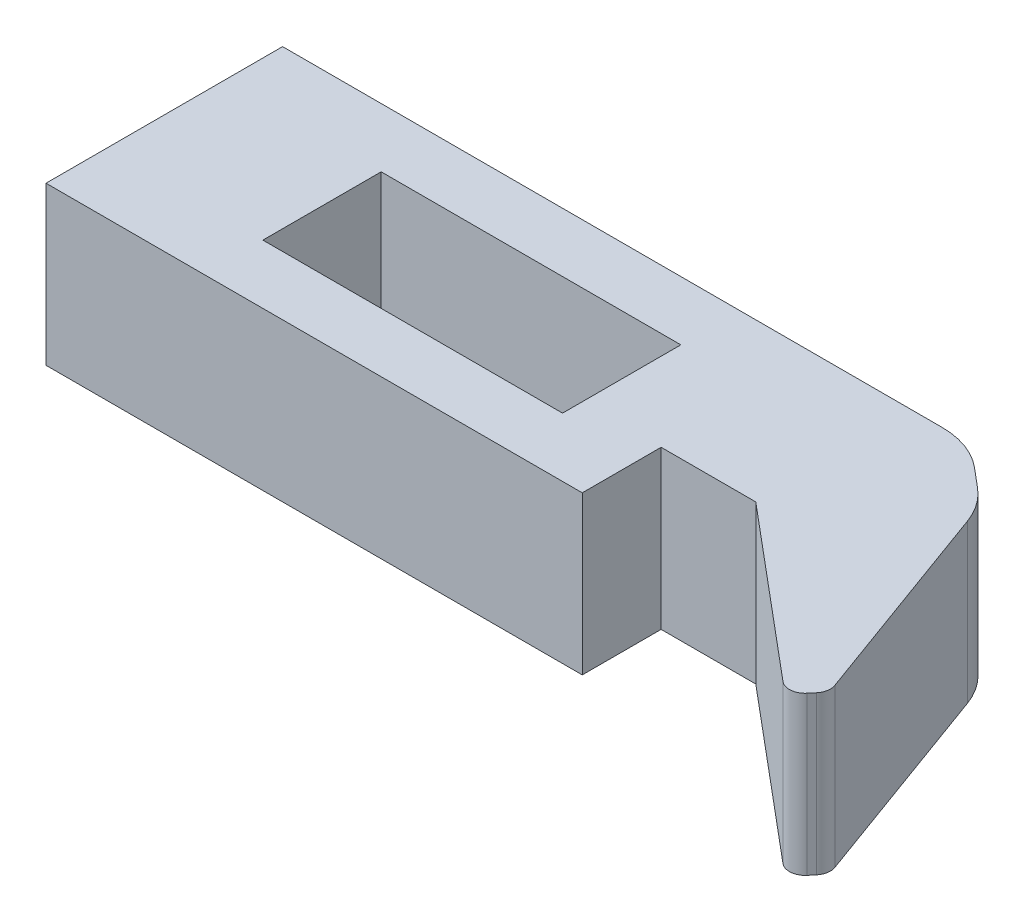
ISO-10303-21;
HEADER;
FILE_DESCRIPTION(('STEP AP214'),'2;1');
FILE_NAME('part.step','',(''),(''),'','','');
FILE_SCHEMA(('AUTOMOTIVE_DESIGN { 1 0 10303 214 1 1 1 1 }'));
ENDSEC;
DATA;
#1=APPLICATION_CONTEXT('core data for automotive mechanical design processes');
#2=APPLICATION_PROTOCOL_DEFINITION('international standard','automotive_design',2000,#1);
#3=PRODUCT_CONTEXT('',#1,'mechanical');
#4=PRODUCT('Part','Part','',(#3));
#5=PRODUCT_RELATED_PRODUCT_CATEGORY('part','',(#4));
#6=PRODUCT_DEFINITION_FORMATION('','',#4);
#7=PRODUCT_DEFINITION_CONTEXT('part definition',#1,'design');
#8=PRODUCT_DEFINITION('design','',#6,#7);
#9=PRODUCT_DEFINITION_SHAPE('','',#8);
#10=(LENGTH_UNIT() NAMED_UNIT(*) SI_UNIT(.MILLI.,.METRE.));
#11=(NAMED_UNIT(*) PLANE_ANGLE_UNIT() SI_UNIT($,.RADIAN.));
#12=(NAMED_UNIT(*) SI_UNIT($,.STERADIAN.) SOLID_ANGLE_UNIT());
#13=UNCERTAINTY_MEASURE_WITH_UNIT(LENGTH_MEASURE(1.E-05),#10,'distance_accuracy_value','');
#14=(GEOMETRIC_REPRESENTATION_CONTEXT(3) GLOBAL_UNCERTAINTY_ASSIGNED_CONTEXT((#13)) GLOBAL_UNIT_ASSIGNED_CONTEXT((#10,
#11,#12)) REPRESENTATION_CONTEXT('',''));
#15=CARTESIAN_POINT('',(0.,0.,0.));
#16=DIRECTION('',(0.,0.,1.));
#17=DIRECTION('',(1.,0.,0.));
#18=AXIS2_PLACEMENT_3D('',#15,#16,#17);
#19=CARTESIAN_POINT('',(0.,2.,0.));
#20=DIRECTION('',(0.,-1.,0.));
#21=DIRECTION('',(0.,0.,-1.));
#22=AXIS2_PLACEMENT_3D('',#19,#20,#21);
#23=PLANE('',#22);
#24=DIRECTION('',(0.642787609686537,0.,-0.76604444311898));
#25=VECTOR('',#24,1.);
#26=CARTESIAN_POINT('',(7.68370854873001,2.,0.896273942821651));
#27=LINE('',#26,#25);
#28=CARTESIAN_POINT('',(6.52669085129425,2.,2.27515394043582));
#29=VERTEX_POINT('',#28);
#30=CARTESIAN_POINT('',(6.5810256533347,2.,2.21040024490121));
#31=VERTEX_POINT('',#30);
#32=EDGE_CURVE('E232',#29,#31,#27,.T.);
#33=ORIENTED_EDGE('',*,*,#32,.T.);
#34=CARTESIAN_POINT('',(6.4278167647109,2.,2.0818427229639));
#35=DIRECTION('',(0.,-1.,0.));
#36=DIRECTION('',(0.,0.,-1.));
#37=AXIS2_PLACEMENT_3D('',#34,#35,#36);
#38=CIRCLE('',#37,0.2);
#39=CARTESIAN_POINT('',(6.61575528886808,2.,2.01343869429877));
#40=VERTEX_POINT('',#39);
#41=EDGE_CURVE('E282',#31,#40,#38,.F.);
#42=ORIENTED_EDGE('',*,*,#41,.T.);
#43=DIRECTION('',(0.342020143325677,0.,0.939692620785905));
#44=VECTOR('',#43,1.);
#45=CARTESIAN_POINT('',(6.65524837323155,2.,2.12194505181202));
#46=LINE('',#45,#44);
#47=CARTESIAN_POINT('',(5.65242793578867,2.,-0.633281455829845));
#48=VERTEX_POINT('',#47);
#49=EDGE_CURVE('E184',#48,#40,#46,.T.);
#50=ORIENTED_EDGE('',*,*,#49,.F.);
#51=CARTESIAN_POINT('',(4.71273531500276,2.,-0.291261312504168));
#52=DIRECTION('',(0.,-1.,0.));
#53=DIRECTION('',(0.,0.,-1.));
#54=AXIS2_PLACEMENT_3D('',#51,#52,#53);
#55=CIRCLE('',#54,1.);
#56=CARTESIAN_POINT('',(5.3555229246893,2.,-1.05730575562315));
#57=VERTEX_POINT('',#56);
#58=EDGE_CURVE('E267',#48,#57,#55,.F.);
#59=ORIENTED_EDGE('',*,*,#58,.T.);
#60=DIRECTION('',(-0.76604444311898,0.,-0.642787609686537));
#61=VECTOR('',#60,1.);
#62=CARTESIAN_POINT('',(4.8279404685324,2.,-1.5));
#63=LINE('',#62,#61);
#64=CARTESIAN_POINT('',(5.10675784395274,2.,-1.26604444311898));
#65=VERTEX_POINT('',#64);
#66=EDGE_CURVE('E235',#57,#65,#63,.T.);
#67=ORIENTED_EDGE('',*,*,#66,.T.);
#68=CARTESIAN_POINT('',(4.4639702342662,2.,-0.5));
#69=DIRECTION('',(0.,-1.,0.));
#70=DIRECTION('',(0.,0.,-1.));
#71=AXIS2_PLACEMENT_3D('',#68,#69,#70);
#72=CIRCLE('',#71,1.);
#73=CARTESIAN_POINT('',(4.4639702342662,2.,-1.5));
#74=VERTEX_POINT('',#73);
#75=EDGE_CURVE('E269',#65,#74,#72,.F.);
#76=ORIENTED_EDGE('',*,*,#75,.T.);
#77=DIRECTION('',(-1.,0.,0.));
#78=VECTOR('',#77,1.);
#79=CARTESIAN_POINT('',(3.9,2.,-1.5));
#80=LINE('',#79,#78);
#81=CARTESIAN_POINT('',(-3.9,2.,-1.5));
#82=VERTEX_POINT('',#81);
#83=EDGE_CURVE('E220',#74,#82,#80,.T.);
#84=ORIENTED_EDGE('',*,*,#83,.T.);
#85=DIRECTION('',(0.,0.,1.));
#86=VECTOR('',#85,1.);
#87=CARTESIAN_POINT('',(-3.9,2.,1.5));
#88=LINE('',#87,#86);
#89=CARTESIAN_POINT('',(-3.9,2.,1.5));
#90=VERTEX_POINT('',#89);
#91=EDGE_CURVE('E222',#82,#90,#88,.T.);
#92=ORIENTED_EDGE('',*,*,#91,.T.);
#93=DIRECTION('',(1.,0.,0.));
#94=VECTOR('',#93,1.);
#95=CARTESIAN_POINT('',(-3.9,2.,1.5));
#96=LINE('',#95,#94);
#97=CARTESIAN_POINT('',(2.9,2.,1.5));
#98=VERTEX_POINT('',#97);
#99=EDGE_CURVE('E225',#90,#98,#96,.T.);
#100=ORIENTED_EDGE('',*,*,#99,.T.);
#101=DIRECTION('',(0.,0.,1.));
#102=VECTOR('',#101,1.);
#103=CARTESIAN_POINT('',(2.9,2.,0.5));
#104=LINE('',#103,#102);
#105=CARTESIAN_POINT('',(2.9,2.,0.5));
#106=VERTEX_POINT('',#105);
#107=EDGE_CURVE('E179',#106,#98,#104,.T.);
#108=ORIENTED_EDGE('',*,*,#107,.F.);
#109=DIRECTION('',(1.,0.,0.));
#110=VECTOR('',#109,1.);
#111=CARTESIAN_POINT('',(3.9,2.,0.5));
#112=LINE('',#111,#110);
#113=CARTESIAN_POINT('',(4.1,2.,0.499999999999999));
#114=VERTEX_POINT('',#113);
#115=EDGE_CURVE('E172',#106,#114,#112,.T.);
#116=ORIENTED_EDGE('',*,*,#115,.T.);
#117=DIRECTION('',(0.76604444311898,0.,0.642787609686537));
#118=VECTOR('',#117,1.);
#119=CARTESIAN_POINT('',(4.1,2.,0.499999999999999));
#120=LINE('',#119,#118);
#121=CARTESIAN_POINT('',(6.24492444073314,2.,2.2998053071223));
#122=VERTEX_POINT('',#121);
#123=EDGE_CURVE('E229',#114,#122,#120,.T.);
#124=ORIENTED_EDGE('',*,*,#123,.T.);
#125=CARTESIAN_POINT('',(6.37348196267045,2.,2.14659641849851));
#126=DIRECTION('',(0.,-1.,0.));
#127=DIRECTION('',(0.,0.,-1.));
#128=AXIS2_PLACEMENT_3D('',#125,#126,#127);
#129=CIRCLE('',#128,0.2);
#130=EDGE_CURVE('E280',#122,#29,#129,.F.);
#131=ORIENTED_EDGE('',*,*,#130,.T.);
#132=EDGE_LOOP('',(#33,#42,#50,#59,#67,#76,#84,#92,#100,#108,#116,#124,#131));
#133=FACE_BOUND('',#132,.T.);
#134=DIRECTION('',(0.,0.,-1.));
#135=VECTOR('',#134,1.);
#136=CARTESIAN_POINT('',(1.9,2.,0.75));
#137=LINE('',#136,#135);
#138=CARTESIAN_POINT('',(1.9,2.,0.75));
#139=VERTEX_POINT('',#138);
#140=CARTESIAN_POINT('',(1.9,2.,-0.75));
#141=VERTEX_POINT('',#140);
#142=EDGE_CURVE('E189',#139,#141,#137,.T.);
#143=ORIENTED_EDGE('',*,*,#142,.F.);
#144=DIRECTION('',(1.,0.,0.));
#145=VECTOR('',#144,1.);
#146=CARTESIAN_POINT('',(-1.9,2.,0.75));
#147=LINE('',#146,#145);
#148=CARTESIAN_POINT('',(-1.9,2.,0.75));
#149=VERTEX_POINT('',#148);
#150=EDGE_CURVE('E197',#149,#139,#147,.T.);
#151=ORIENTED_EDGE('',*,*,#150,.F.);
#152=DIRECTION('',(0.,0.,1.));
#153=VECTOR('',#152,1.);
#154=CARTESIAN_POINT('',(-1.9,2.,0.75));
#155=LINE('',#154,#153);
#156=CARTESIAN_POINT('',(-1.9,2.,-0.75));
#157=VERTEX_POINT('',#156);
#158=EDGE_CURVE('E194',#157,#149,#155,.T.);
#159=ORIENTED_EDGE('',*,*,#158,.F.);
#160=DIRECTION('',(-1.,0.,0.));
#161=VECTOR('',#160,1.);
#162=CARTESIAN_POINT('',(-1.9,2.,-0.75));
#163=LINE('',#162,#161);
#164=EDGE_CURVE('E191',#141,#157,#163,.T.);
#165=ORIENTED_EDGE('',*,*,#164,.F.);
#166=EDGE_LOOP('',(#143,#151,#159,#165));
#167=FACE_BOUND('',#166,.T.);
#168=ADVANCED_FACE('F36',(#133,#167),#23,.F.);
#169=CARTESIAN_POINT('',(0.,0.,0.));
#170=DIRECTION('',(0.,-1.,0.));
#171=DIRECTION('',(0.,0.,-1.));
#172=AXIS2_PLACEMENT_3D('',#169,#170,#171);
#173=PLANE('',#172);
#174=DIRECTION('',(0.342020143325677,0.,0.939692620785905));
#175=VECTOR('',#174,1.);
#176=CARTESIAN_POINT('',(6.65524837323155,0.,2.12194505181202));
#177=LINE('',#176,#175);
#178=CARTESIAN_POINT('',(5.65242793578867,0.,-0.633281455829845));
#179=VERTEX_POINT('',#178);
#180=CARTESIAN_POINT('',(6.61575528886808,0.,2.01343869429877));
#181=VERTEX_POINT('',#180);
#182=EDGE_CURVE('E181',#179,#181,#177,.T.);
#183=ORIENTED_EDGE('',*,*,#182,.T.);
#184=CARTESIAN_POINT('',(6.4278167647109,0.,2.0818427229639));
#185=DIRECTION('',(0.,-1.,0.));
#186=DIRECTION('',(0.,0.,-1.));
#187=AXIS2_PLACEMENT_3D('',#184,#185,#186);
#188=CIRCLE('',#187,0.2);
#189=CARTESIAN_POINT('',(6.5810256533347,0.,2.21040024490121));
#190=VERTEX_POINT('',#189);
#191=EDGE_CURVE('E44',#181,#190,#188,.T.);
#192=ORIENTED_EDGE('',*,*,#191,.T.);
#193=DIRECTION('',(0.642787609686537,0.,-0.76604444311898));
#194=VECTOR('',#193,1.);
#195=CARTESIAN_POINT('',(7.68370854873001,0.,0.896273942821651));
#196=LINE('',#195,#194);
#197=CARTESIAN_POINT('',(6.52669085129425,0.,2.27515394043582));
#198=VERTEX_POINT('',#197);
#199=EDGE_CURVE('E244',#198,#190,#196,.T.);
#200=ORIENTED_EDGE('',*,*,#199,.F.);
#201=CARTESIAN_POINT('',(6.37348196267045,0.,2.14659641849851));
#202=DIRECTION('',(0.,-1.,0.));
#203=DIRECTION('',(0.,0.,-1.));
#204=AXIS2_PLACEMENT_3D('',#201,#202,#203);
#205=CIRCLE('',#204,0.2);
#206=CARTESIAN_POINT('',(6.24492444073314,0.,2.2998053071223));
#207=VERTEX_POINT('',#206);
#208=EDGE_CURVE('E51',#198,#207,#205,.T.);
#209=ORIENTED_EDGE('',*,*,#208,.T.);
#210=DIRECTION('',(0.76604444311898,0.,0.642787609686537));
#211=VECTOR('',#210,1.);
#212=CARTESIAN_POINT('',(4.1,0.,0.499999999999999));
#213=LINE('',#212,#211);
#214=CARTESIAN_POINT('',(4.1,0.,0.499999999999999));
#215=VERTEX_POINT('',#214);
#216=EDGE_CURVE('E163',#215,#207,#213,.T.);
#217=ORIENTED_EDGE('',*,*,#216,.F.);
#218=DIRECTION('',(1.,0.,0.));
#219=VECTOR('',#218,1.);
#220=CARTESIAN_POINT('',(3.9,0.,0.5));
#221=LINE('',#220,#219);
#222=CARTESIAN_POINT('',(2.9,0.,0.5));
#223=VERTEX_POINT('',#222);
#224=EDGE_CURVE('E155',#223,#215,#221,.T.);
#225=ORIENTED_EDGE('',*,*,#224,.F.);
#226=DIRECTION('',(0.,0.,1.));
#227=VECTOR('',#226,1.);
#228=CARTESIAN_POINT('',(2.9,0.,0.5));
#229=LINE('',#228,#227);
#230=CARTESIAN_POINT('',(2.9,0.,1.5));
#231=VERTEX_POINT('',#230);
#232=EDGE_CURVE('E161',#223,#231,#229,.T.);
#233=ORIENTED_EDGE('',*,*,#232,.T.);
#234=DIRECTION('',(1.,0.,0.));
#235=VECTOR('',#234,1.);
#236=CARTESIAN_POINT('',(-3.9,0.,1.5));
#237=LINE('',#236,#235);
#238=CARTESIAN_POINT('',(-3.9,0.,1.5));
#239=VERTEX_POINT('',#238);
#240=EDGE_CURVE('E167',#239,#231,#237,.T.);
#241=ORIENTED_EDGE('',*,*,#240,.F.);
#242=DIRECTION('',(0.,0.,1.));
#243=VECTOR('',#242,1.);
#244=CARTESIAN_POINT('',(-3.9,0.,1.5));
#245=LINE('',#244,#243);
#246=CARTESIAN_POINT('',(-3.9,0.,-1.5));
#247=VERTEX_POINT('',#246);
#248=EDGE_CURVE('E240',#247,#239,#245,.T.);
#249=ORIENTED_EDGE('',*,*,#248,.F.);
#250=DIRECTION('',(-1.,0.,0.));
#251=VECTOR('',#250,1.);
#252=CARTESIAN_POINT('',(-3.9,0.,-1.5));
#253=LINE('',#252,#251);
#254=CARTESIAN_POINT('',(4.4639702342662,0.,-1.5));
#255=VERTEX_POINT('',#254);
#256=EDGE_CURVE('E219',#255,#247,#253,.T.);
#257=ORIENTED_EDGE('',*,*,#256,.F.);
#258=CARTESIAN_POINT('',(4.4639702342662,0.,-0.5));
#259=DIRECTION('',(0.,-1.,0.));
#260=DIRECTION('',(0.,0.,-1.));
#261=AXIS2_PLACEMENT_3D('',#258,#259,#260);
#262=CIRCLE('',#261,1.);
#263=CARTESIAN_POINT('',(5.10675784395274,0.,-1.26604444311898));
#264=VERTEX_POINT('',#263);
#265=EDGE_CURVE('E261',#255,#264,#262,.T.);
#266=ORIENTED_EDGE('',*,*,#265,.T.);
#267=DIRECTION('',(-0.76604444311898,0.,-0.642787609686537));
#268=VECTOR('',#267,1.);
#269=CARTESIAN_POINT('',(4.8279404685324,0.,-1.5));
#270=LINE('',#269,#268);
#271=CARTESIAN_POINT('',(5.3555229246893,0.,-1.05730575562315));
#272=VERTEX_POINT('',#271);
#273=EDGE_CURVE('E223',#272,#264,#270,.T.);
#274=ORIENTED_EDGE('',*,*,#273,.F.);
#275=CARTESIAN_POINT('',(4.71273531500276,0.,-0.291261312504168));
#276=DIRECTION('',(0.,-1.,0.));
#277=DIRECTION('',(0.,0.,-1.));
#278=AXIS2_PLACEMENT_3D('',#275,#276,#277);
#279=CIRCLE('',#278,1.);
#280=EDGE_CURVE('E259',#272,#179,#279,.T.);
#281=ORIENTED_EDGE('',*,*,#280,.T.);
#282=EDGE_LOOP('',(#183,#192,#200,#209,#217,#225,#233,#241,#249,#257,#266,#274,#281));
#283=FACE_BOUND('',#282,.T.);
#284=DIRECTION('',(1.,0.,0.));
#285=VECTOR('',#284,1.);
#286=CARTESIAN_POINT('',(-1.9,0.,0.75));
#287=LINE('',#286,#285);
#288=CARTESIAN_POINT('',(-1.9,0.,0.75));
#289=VERTEX_POINT('',#288);
#290=CARTESIAN_POINT('',(1.9,0.,0.75));
#291=VERTEX_POINT('',#290);
#292=EDGE_CURVE('E192',#289,#291,#287,.T.);
#293=ORIENTED_EDGE('',*,*,#292,.T.);
#294=DIRECTION('',(0.,0.,-1.));
#295=VECTOR('',#294,1.);
#296=CARTESIAN_POINT('',(1.9,0.,0.75));
#297=LINE('',#296,#295);
#298=CARTESIAN_POINT('',(1.9,0.,-0.75));
#299=VERTEX_POINT('',#298);
#300=EDGE_CURVE('E187',#291,#299,#297,.T.);
#301=ORIENTED_EDGE('',*,*,#300,.T.);
#302=DIRECTION('',(-1.,0.,0.));
#303=VECTOR('',#302,1.);
#304=CARTESIAN_POINT('',(-1.9,0.,-0.75));
#305=LINE('',#304,#303);
#306=CARTESIAN_POINT('',(-1.9,0.,-0.75));
#307=VERTEX_POINT('',#306);
#308=EDGE_CURVE('E202',#299,#307,#305,.T.);
#309=ORIENTED_EDGE('',*,*,#308,.T.);
#310=DIRECTION('',(0.,0.,1.));
#311=VECTOR('',#310,1.);
#312=CARTESIAN_POINT('',(-1.9,0.,0.75));
#313=LINE('',#312,#311);
#314=EDGE_CURVE('E205',#307,#289,#313,.T.);
#315=ORIENTED_EDGE('',*,*,#314,.T.);
#316=EDGE_LOOP('',(#293,#301,#309,#315));
#317=FACE_BOUND('',#316,.T.);
#318=ADVANCED_FACE('F157',(#283,#317),#173,.T.);
#319=CARTESIAN_POINT('',(-3.9,2.,-1.5));
#320=DIRECTION('',(0.,0.,1.));
#321=DIRECTION('',(1.,0.,0.));
#322=AXIS2_PLACEMENT_3D('',#319,#320,#321);
#323=PLANE('',#322);
#324=ORIENTED_EDGE('',*,*,#83,.F.);
#325=DIRECTION('',(0.,-1.,0.));
#326=VECTOR('',#325,1.);
#327=CARTESIAN_POINT('',(4.4639702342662,2.,-1.5));
#328=LINE('',#327,#326);
#329=EDGE_CURVE('E256',#74,#255,#328,.T.);
#330=ORIENTED_EDGE('',*,*,#329,.T.);
#331=ORIENTED_EDGE('',*,*,#256,.T.);
#332=DIRECTION('',(0.,-1.,0.));
#333=VECTOR('',#332,1.);
#334=CARTESIAN_POINT('',(-3.9,2.,-1.5));
#335=LINE('',#334,#333);
#336=EDGE_CURVE('E253',#82,#247,#335,.T.);
#337=ORIENTED_EDGE('',*,*,#336,.F.);
#338=EDGE_LOOP('',(#324,#330,#331,#337));
#339=FACE_BOUND('',#338,.T.);
#340=ADVANCED_FACE('F314',(#339),#323,.F.);
#341=CARTESIAN_POINT('',(-3.9,2.,1.5));
#342=DIRECTION('',(1.,0.,0.));
#343=DIRECTION('',(0.,0.,-1.));
#344=AXIS2_PLACEMENT_3D('',#341,#342,#343);
#345=PLANE('',#344);
#346=ORIENTED_EDGE('',*,*,#248,.T.);
#347=DIRECTION('',(0.,-1.,0.));
#348=VECTOR('',#347,1.);
#349=CARTESIAN_POINT('',(-3.9,2.,1.5));
#350=LINE('',#349,#348);
#351=EDGE_CURVE('E250',#90,#239,#350,.T.);
#352=ORIENTED_EDGE('',*,*,#351,.F.);
#353=ORIENTED_EDGE('',*,*,#91,.F.);
#354=ORIENTED_EDGE('',*,*,#336,.T.);
#355=EDGE_LOOP('',(#346,#352,#353,#354));
#356=FACE_BOUND('',#355,.T.);
#357=ADVANCED_FACE('F320',(#356),#345,.F.);
#358=CARTESIAN_POINT('',(-3.9,2.,1.5));
#359=DIRECTION('',(0.,0.,-1.));
#360=DIRECTION('',(-1.,0.,0.));
#361=AXIS2_PLACEMENT_3D('',#358,#359,#360);
#362=PLANE('',#361);
#363=ORIENTED_EDGE('',*,*,#240,.T.);
#364=DIRECTION('',(0.,1.,0.));
#365=VECTOR('',#364,1.);
#366=CARTESIAN_POINT('',(2.9,0.,1.5));
#367=LINE('',#366,#365);
#368=EDGE_CURVE('E175',#231,#98,#367,.T.);
#369=ORIENTED_EDGE('',*,*,#368,.T.);
#370=ORIENTED_EDGE('',*,*,#99,.F.);
#371=ORIENTED_EDGE('',*,*,#351,.T.);
#372=EDGE_LOOP('',(#363,#369,#370,#371));
#373=FACE_BOUND('',#372,.T.);
#374=ADVANCED_FACE('F323',(#373),#362,.F.);
#375=CARTESIAN_POINT('',(3.9,2.,0.5));
#376=DIRECTION('',(0.,0.,-1.));
#377=DIRECTION('',(-1.,0.,0.));
#378=AXIS2_PLACEMENT_3D('',#375,#376,#377);
#379=PLANE('',#378);
#380=ORIENTED_EDGE('',*,*,#224,.T.);
#381=DIRECTION('',(0.,-1.,0.));
#382=VECTOR('',#381,1.);
#383=CARTESIAN_POINT('',(4.1,2.,0.499999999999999));
#384=LINE('',#383,#382);
#385=EDGE_CURVE('E238',#114,#215,#384,.T.);
#386=ORIENTED_EDGE('',*,*,#385,.F.);
#387=ORIENTED_EDGE('',*,*,#115,.F.);
#388=DIRECTION('',(0.,1.,0.));
#389=VECTOR('',#388,1.);
#390=CARTESIAN_POINT('',(2.9,0.,0.5));
#391=LINE('',#390,#389);
#392=EDGE_CURVE('E170',#223,#106,#391,.T.);
#393=ORIENTED_EDGE('',*,*,#392,.F.);
#394=EDGE_LOOP('',(#380,#386,#387,#393));
#395=FACE_BOUND('',#394,.T.);
#396=ADVANCED_FACE('F171',(#395),#379,.F.);
#397=CARTESIAN_POINT('',(4.1,2.,0.499999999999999));
#398=DIRECTION('',(0.642787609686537,0.,-0.76604444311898));
#399=DIRECTION('',(-0.76604444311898,0.,-0.642787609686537));
#400=AXIS2_PLACEMENT_3D('',#397,#398,#399);
#401=PLANE('',#400);
#402=ORIENTED_EDGE('',*,*,#216,.T.);
#403=DIRECTION('',(0.,-1.,0.));
#404=VECTOR('',#403,1.);
#405=CARTESIAN_POINT('',(6.24492444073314,2.,2.2998053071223));
#406=LINE('',#405,#404);
#407=EDGE_CURVE('E11',#207,#122,#406,.F.);
#408=ORIENTED_EDGE('',*,*,#407,.T.);
#409=ORIENTED_EDGE('',*,*,#123,.F.);
#410=ORIENTED_EDGE('',*,*,#385,.T.);
#411=EDGE_LOOP('',(#402,#408,#409,#410));
#412=FACE_BOUND('',#411,.T.);
#413=ADVANCED_FACE('F330',(#412),#401,.F.);
#414=CARTESIAN_POINT('',(7.68370854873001,2.,0.896273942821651));
#415=DIRECTION('',(-0.76604444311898,0.,-0.642787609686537));
#416=DIRECTION('',(-0.642787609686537,0.,0.76604444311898));
#417=AXIS2_PLACEMENT_3D('',#414,#415,#416);
#418=PLANE('',#417);
#419=ORIENTED_EDGE('',*,*,#199,.T.);
#420=DIRECTION('',(0.,1.,0.));
#421=VECTOR('',#420,1.);
#422=CARTESIAN_POINT('',(6.5810256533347,2.,2.21040024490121));
#423=LINE('',#422,#421);
#424=EDGE_CURVE('E277',#190,#31,#423,.T.);
#425=ORIENTED_EDGE('',*,*,#424,.T.);
#426=ORIENTED_EDGE('',*,*,#32,.F.);
#427=DIRECTION('',(0.,-1.,0.));
#428=VECTOR('',#427,1.);
#429=CARTESIAN_POINT('',(6.52669085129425,2.,2.27515394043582));
#430=LINE('',#429,#428);
#431=EDGE_CURVE('E274',#29,#198,#430,.T.);
#432=ORIENTED_EDGE('',*,*,#431,.T.);
#433=EDGE_LOOP('',(#419,#425,#426,#432));
#434=FACE_BOUND('',#433,.T.);
#435=ADVANCED_FACE('F289',(#434),#418,.F.);
#436=CARTESIAN_POINT('',(4.8279404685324,2.,-1.5));
#437=DIRECTION('',(-0.642787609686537,0.,0.76604444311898));
#438=DIRECTION('',(0.76604444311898,0.,0.642787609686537));
#439=AXIS2_PLACEMENT_3D('',#436,#437,#438);
#440=PLANE('',#439);
#441=ORIENTED_EDGE('',*,*,#273,.T.);
#442=DIRECTION('',(0.,-1.,0.));
#443=VECTOR('',#442,1.);
#444=CARTESIAN_POINT('',(5.10675784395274,2.,-1.26604444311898));
#445=LINE('',#444,#443);
#446=EDGE_CURVE('E265',#264,#65,#445,.F.);
#447=ORIENTED_EDGE('',*,*,#446,.T.);
#448=ORIENTED_EDGE('',*,*,#66,.F.);
#449=DIRECTION('',(0.,1.,0.));
#450=VECTOR('',#449,1.);
#451=CARTESIAN_POINT('',(5.3555229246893,2.,-1.05730575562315));
#452=LINE('',#451,#450);
#453=EDGE_CURVE('E263',#57,#272,#452,.F.);
#454=ORIENTED_EDGE('',*,*,#453,.T.);
#455=EDGE_LOOP('',(#441,#447,#448,#454));
#456=FACE_BOUND('',#455,.T.);
#457=ADVANCED_FACE('F305',(#456),#440,.F.);
#458=CARTESIAN_POINT('',(1.9,2.,0.75));
#459=DIRECTION('',(-1.,0.,0.));
#460=DIRECTION('',(0.,0.,1.));
#461=AXIS2_PLACEMENT_3D('',#458,#459,#460);
#462=PLANE('',#461);
#463=ORIENTED_EDGE('',*,*,#300,.F.);
#464=DIRECTION('',(0.,-1.,0.));
#465=VECTOR('',#464,1.);
#466=CARTESIAN_POINT('',(1.9,2.,0.75));
#467=LINE('',#466,#465);
#468=EDGE_CURVE('E199',#139,#291,#467,.T.);
#469=ORIENTED_EDGE('',*,*,#468,.F.);
#470=ORIENTED_EDGE('',*,*,#142,.T.);
#471=DIRECTION('',(0.,-1.,0.));
#472=VECTOR('',#471,1.);
#473=CARTESIAN_POINT('',(1.9,2.,-0.75));
#474=LINE('',#473,#472);
#475=EDGE_CURVE('E216',#141,#299,#474,.T.);
#476=ORIENTED_EDGE('',*,*,#475,.T.);
#477=EDGE_LOOP('',(#463,#469,#470,#476));
#478=FACE_BOUND('',#477,.T.);
#479=ADVANCED_FACE('F340',(#478),#462,.T.);
#480=CARTESIAN_POINT('',(-1.9,2.,-0.75));
#481=DIRECTION('',(0.,0.,1.));
#482=DIRECTION('',(1.,0.,0.));
#483=AXIS2_PLACEMENT_3D('',#480,#481,#482);
#484=PLANE('',#483);
#485=ORIENTED_EDGE('',*,*,#308,.F.);
#486=ORIENTED_EDGE('',*,*,#475,.F.);
#487=ORIENTED_EDGE('',*,*,#164,.T.);
#488=DIRECTION('',(0.,-1.,0.));
#489=VECTOR('',#488,1.);
#490=CARTESIAN_POINT('',(-1.9,2.,-0.75));
#491=LINE('',#490,#489);
#492=EDGE_CURVE('E214',#157,#307,#491,.T.);
#493=ORIENTED_EDGE('',*,*,#492,.T.);
#494=EDGE_LOOP('',(#485,#486,#487,#493));
#495=FACE_BOUND('',#494,.T.);
#496=ADVANCED_FACE('F387',(#495),#484,.T.);
#497=CARTESIAN_POINT('',(-1.9,2.,0.75));
#498=DIRECTION('',(1.,0.,0.));
#499=DIRECTION('',(0.,0.,-1.));
#500=AXIS2_PLACEMENT_3D('',#497,#498,#499);
#501=PLANE('',#500);
#502=ORIENTED_EDGE('',*,*,#314,.F.);
#503=ORIENTED_EDGE('',*,*,#492,.F.);
#504=ORIENTED_EDGE('',*,*,#158,.T.);
#505=DIRECTION('',(0.,-1.,0.));
#506=VECTOR('',#505,1.);
#507=CARTESIAN_POINT('',(-1.9,2.,0.75));
#508=LINE('',#507,#506);
#509=EDGE_CURVE('E212',#149,#289,#508,.T.);
#510=ORIENTED_EDGE('',*,*,#509,.T.);
#511=EDGE_LOOP('',(#502,#503,#504,#510));
#512=FACE_BOUND('',#511,.T.);
#513=ADVANCED_FACE('F397',(#512),#501,.T.);
#514=CARTESIAN_POINT('',(-1.9,2.,0.75));
#515=DIRECTION('',(0.,0.,-1.));
#516=DIRECTION('',(-1.,0.,0.));
#517=AXIS2_PLACEMENT_3D('',#514,#515,#516);
#518=PLANE('',#517);
#519=ORIENTED_EDGE('',*,*,#292,.F.);
#520=ORIENTED_EDGE('',*,*,#509,.F.);
#521=ORIENTED_EDGE('',*,*,#150,.T.);
#522=ORIENTED_EDGE('',*,*,#468,.T.);
#523=EDGE_LOOP('',(#519,#520,#521,#522));
#524=FACE_BOUND('',#523,.T.);
#525=ADVANCED_FACE('F406',(#524),#518,.T.);
#526=CARTESIAN_POINT('',(2.9,0.,0.5));
#527=DIRECTION('',(-1.,0.,0.));
#528=DIRECTION('',(0.,0.,1.));
#529=AXIS2_PLACEMENT_3D('',#526,#527,#528);
#530=PLANE('',#529);
#531=ORIENTED_EDGE('',*,*,#107,.T.);
#532=ORIENTED_EDGE('',*,*,#368,.F.);
#533=ORIENTED_EDGE('',*,*,#232,.F.);
#534=ORIENTED_EDGE('',*,*,#392,.T.);
#535=EDGE_LOOP('',(#531,#532,#533,#534));
#536=FACE_BOUND('',#535,.T.);
#537=ADVANCED_FACE('F177',(#536),#530,.F.);
#538=CARTESIAN_POINT('',(6.65524837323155,0.,2.12194505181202));
#539=DIRECTION('',(-0.939692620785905,0.,0.342020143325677));
#540=DIRECTION('',(0.342020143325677,0.,0.939692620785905));
#541=AXIS2_PLACEMENT_3D('',#538,#539,#540);
#542=PLANE('',#541);
#543=ORIENTED_EDGE('',*,*,#49,.T.);
#544=DIRECTION('',(0.,1.,0.));
#545=VECTOR('',#544,1.);
#546=CARTESIAN_POINT('',(6.61575528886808,0.,2.01343869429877));
#547=LINE('',#546,#545);
#548=EDGE_CURVE('E59',#40,#181,#547,.F.);
#549=ORIENTED_EDGE('',*,*,#548,.T.);
#550=ORIENTED_EDGE('',*,*,#182,.F.);
#551=DIRECTION('',(0.,1.,0.));
#552=VECTOR('',#551,1.);
#553=CARTESIAN_POINT('',(5.65242793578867,0.,-0.633281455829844));
#554=LINE('',#553,#552);
#555=EDGE_CURVE('E271',#179,#48,#554,.T.);
#556=ORIENTED_EDGE('',*,*,#555,.T.);
#557=EDGE_LOOP('',(#543,#549,#550,#556));
#558=FACE_BOUND('',#557,.T.);
#559=ADVANCED_FACE('F296',(#558),#542,.F.);
#560=CARTESIAN_POINT('',(4.4639702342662,2.,-0.5));
#561=DIRECTION('',(0.,-1.,0.));
#562=DIRECTION('',(0.,0.,-1.));
#563=AXIS2_PLACEMENT_3D('',#560,#561,#562);
#564=CYLINDRICAL_SURFACE('',#563,1.);
#565=ORIENTED_EDGE('',*,*,#75,.F.);
#566=ORIENTED_EDGE('',*,*,#446,.F.);
#567=ORIENTED_EDGE('',*,*,#265,.F.);
#568=ORIENTED_EDGE('',*,*,#329,.F.);
#569=EDGE_LOOP('',(#565,#566,#567,#568));
#570=FACE_BOUND('',#569,.T.);
#571=ADVANCED_FACE('F309',(#570),#564,.T.);
#572=CARTESIAN_POINT('',(4.71273531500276,0.,-0.291261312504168));
#573=DIRECTION('',(0.,1.,0.));
#574=DIRECTION('',(0.,0.,1.));
#575=AXIS2_PLACEMENT_3D('',#572,#573,#574);
#576=CYLINDRICAL_SURFACE('',#575,1.);
#577=ORIENTED_EDGE('',*,*,#280,.F.);
#578=ORIENTED_EDGE('',*,*,#453,.F.);
#579=ORIENTED_EDGE('',*,*,#58,.F.);
#580=ORIENTED_EDGE('',*,*,#555,.F.);
#581=EDGE_LOOP('',(#577,#578,#579,#580));
#582=FACE_BOUND('',#581,.T.);
#583=ADVANCED_FACE('F300',(#582),#576,.T.);
#584=CARTESIAN_POINT('',(6.4278167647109,2.,2.0818427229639));
#585=DIRECTION('',(0.,1.,0.));
#586=DIRECTION('',(0.,0.,1.));
#587=AXIS2_PLACEMENT_3D('',#584,#585,#586);
#588=CYLINDRICAL_SURFACE('',#587,0.2);
#589=ORIENTED_EDGE('',*,*,#191,.F.);
#590=ORIENTED_EDGE('',*,*,#548,.F.);
#591=ORIENTED_EDGE('',*,*,#41,.F.);
#592=ORIENTED_EDGE('',*,*,#424,.F.);
#593=EDGE_LOOP('',(#589,#590,#591,#592));
#594=FACE_BOUND('',#593,.T.);
#595=ADVANCED_FACE('F292',(#594),#588,.T.);
#596=CARTESIAN_POINT('',(6.37348196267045,2.,2.14659641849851));
#597=DIRECTION('',(0.,-1.,0.));
#598=DIRECTION('',(0.,0.,-1.));
#599=AXIS2_PLACEMENT_3D('',#596,#597,#598);
#600=CYLINDRICAL_SURFACE('',#599,0.2);
#601=ORIENTED_EDGE('',*,*,#130,.F.);
#602=ORIENTED_EDGE('',*,*,#407,.F.);
#603=ORIENTED_EDGE('',*,*,#208,.F.);
#604=ORIENTED_EDGE('',*,*,#431,.F.);
#605=EDGE_LOOP('',(#601,#602,#603,#604));
#606=FACE_BOUND('',#605,.T.);
#607=ADVANCED_FACE('F38',(#606),#600,.T.);
#608=CLOSED_SHELL('',(#168,#318,#340,#357,#374,#396,#413,#435,#457,#479,#496,#513,#525,#537,
#559,#571,#583,#595,#607));
#609=MANIFOLD_SOLID_BREP('B2',#608);
#610=ADVANCED_BREP_SHAPE_REPRESENTATION('',(#18,#609),#14);
#611=SHAPE_DEFINITION_REPRESENTATION(#9,#610);
ENDSEC;
END-ISO-10303-21;
